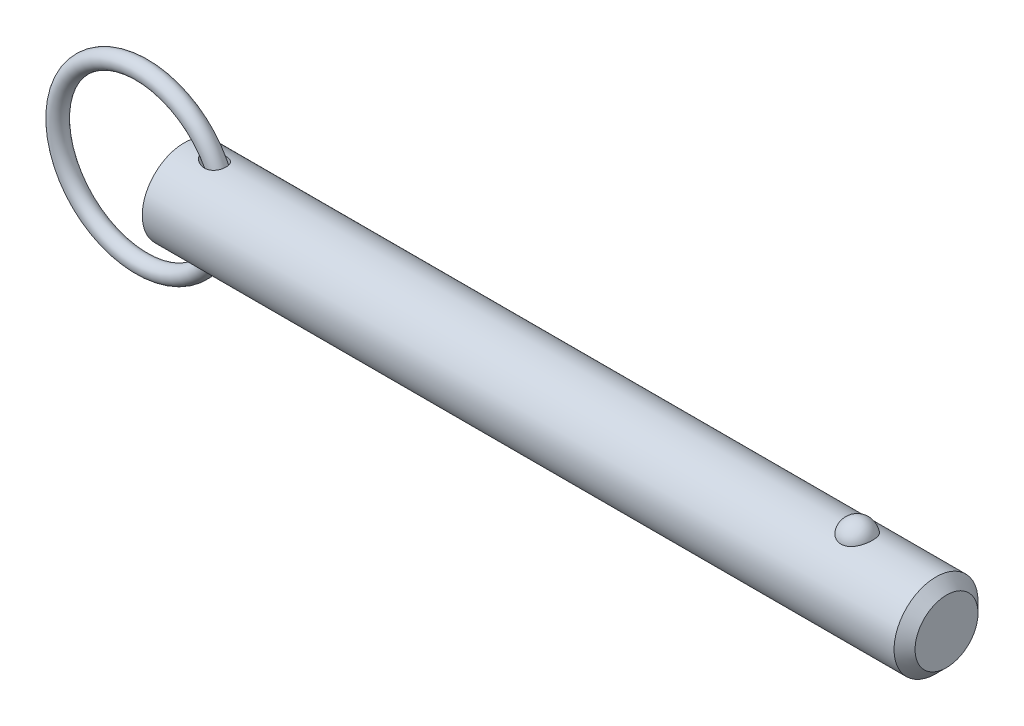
ISO-10303-21;
HEADER;
FILE_DESCRIPTION(('STEP AP214'),'2;1');
FILE_NAME('part.step','',(''),(''),'','','');
FILE_SCHEMA(('AUTOMOTIVE_DESIGN { 1 0 10303 214 1 1 1 1 }'));
ENDSEC;
DATA;
#1=APPLICATION_CONTEXT('core data for automotive mechanical design processes');
#2=APPLICATION_PROTOCOL_DEFINITION('international standard','automotive_design',2000,#1);
#3=PRODUCT_CONTEXT('',#1,'mechanical');
#4=PRODUCT('Part','Part','',(#3));
#5=PRODUCT_RELATED_PRODUCT_CATEGORY('part','',(#4));
#6=PRODUCT_DEFINITION_FORMATION('','',#4);
#7=PRODUCT_DEFINITION_CONTEXT('part definition',#1,'design');
#8=PRODUCT_DEFINITION('design','',#6,#7);
#9=PRODUCT_DEFINITION_SHAPE('','',#8);
#10=(LENGTH_UNIT() NAMED_UNIT(*) SI_UNIT(.MILLI.,.METRE.));
#11=(NAMED_UNIT(*) PLANE_ANGLE_UNIT() SI_UNIT($,.RADIAN.));
#12=(NAMED_UNIT(*) SI_UNIT($,.STERADIAN.) SOLID_ANGLE_UNIT());
#13=UNCERTAINTY_MEASURE_WITH_UNIT(LENGTH_MEASURE(1.E-05),#10,'distance_accuracy_value','');
#14=(GEOMETRIC_REPRESENTATION_CONTEXT(3) GLOBAL_UNCERTAINTY_ASSIGNED_CONTEXT((#13)) GLOBAL_UNIT_ASSIGNED_CONTEXT((#10,
#11,#12)) REPRESENTATION_CONTEXT('',''));
#15=CARTESIAN_POINT('',(0.,0.,0.));
#16=DIRECTION('',(0.,0.,1.));
#17=DIRECTION('',(1.,0.,0.));
#18=AXIS2_PLACEMENT_3D('',#15,#16,#17);
#19=CARTESIAN_POINT('',(-9.66825126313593,0.,0.));
#20=DIRECTION('',(0.,0.,1.));
#21=DIRECTION('',(1.,0.,0.));
#22=AXIS2_PLACEMENT_3D('',#19,#20,#21);
#23=TOROIDAL_SURFACE('',#22,19.05,1.905);
#24=CARTESIAN_POINT('',(11.2867487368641,0.,0.));
#25=VERTEX_POINT('',#24);
#26=VERTEX_LOOP('',#25);
#27=FACE_BOUND('',#26,.T.);
#28=ADVANCED_FACE('P0_F12',(#27),#23,.T.);
#29=CLOSED_SHELL('',(#28));
#30=MANIFOLD_SOLID_BREP('P0_B1',#29);
#31=CARTESIAN_POINT('',(0.,0.,0.));
#32=DIRECTION('',(1.,0.,0.));
#33=DIRECTION('',(0.,0.,-1.));
#34=AXIS2_PLACEMENT_3D('',#31,#32,#33);
#35=CYLINDRICAL_SURFACE('',#34,9.525);
#36=CARTESIAN_POINT('',(4.56693409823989,9.43141941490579,-1.33189820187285));
#37=CARTESIAN_POINT('',(4.70260475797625,9.41020313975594,-1.48215931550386));
#38=CARTESIAN_POINT('',(4.85555680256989,9.38755003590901,-1.61683982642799));
#39=CARTESIAN_POINT('',(5.10171959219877,9.35450554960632,-1.79512943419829));
#40=CARTESIAN_POINT('',(5.18674514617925,9.34362629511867,-1.85068909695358));
#41=CARTESIAN_POINT('',(5.3615438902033,9.32258514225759,-1.95392002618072));
#42=CARTESIAN_POINT('',(5.45131542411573,9.31242299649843,-2.00159402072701));
#43=CARTESIAN_POINT('',(5.70070211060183,9.28632120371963,-2.12033289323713));
#44=CARTESIAN_POINT('',(5.86420408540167,9.27146938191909,-2.18362944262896));
#45=CARTESIAN_POINT('',(6.19893345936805,9.24694163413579,-2.28525783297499));
#46=CARTESIAN_POINT('',(6.3701538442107,9.23726110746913,-2.32361187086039));
#47=CARTESIAN_POINT('',(6.73531776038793,9.22400982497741,-2.37575048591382));
#48=CARTESIAN_POINT('',(6.92975826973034,9.22118808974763,-2.38652934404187));
#49=CARTESIAN_POINT('',(7.21995443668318,9.22416297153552,-2.37494980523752));
#50=CARTESIAN_POINT('',(7.31643847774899,9.22635560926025,-2.366466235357));
#51=CARTESIAN_POINT('',(7.50796421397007,9.2331428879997,-2.33985028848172));
#52=CARTESIAN_POINT('',(7.6030065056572,9.23773650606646,-2.32172202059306));
#53=CARTESIAN_POINT('',(7.83273114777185,9.25183311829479,-2.26504721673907));
#54=CARTESIAN_POINT('',(7.96603028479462,9.26261470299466,-2.2209856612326));
#55=CARTESIAN_POINT('',(8.22310899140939,9.28816519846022,-2.1115730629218));
#56=CARTESIAN_POINT('',(8.34689477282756,9.30293147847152,-2.04623606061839));
#57=CARTESIAN_POINT('',(8.58136049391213,9.3349416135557,-1.89485344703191));
#58=CARTESIAN_POINT('',(8.69199721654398,9.35219324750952,-1.80874222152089));
#59=CARTESIAN_POINT('',(8.89592093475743,9.38707016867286,-1.61799188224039));
#60=CARTESIAN_POINT('',(8.98920771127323,9.40469546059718,-1.51335253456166));
#61=CARTESIAN_POINT('',(9.15057731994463,9.43713590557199,-1.29519427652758));
#62=CARTESIAN_POINT('',(9.21980158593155,9.45205440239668,-1.18253282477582));
#63=CARTESIAN_POINT('',(9.33826736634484,9.47856708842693,-0.946802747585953));
#64=CARTESIAN_POINT('',(9.38751161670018,9.49016173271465,-0.823735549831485));
#65=CARTESIAN_POINT('',(9.46423850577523,9.50859378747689,-0.57261402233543));
#66=CARTESIAN_POINT('',(9.49202393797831,9.5154972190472,-0.444656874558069));
#67=CARTESIAN_POINT('',(9.52636926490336,9.52406905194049,-0.185752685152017));
#68=CARTESIAN_POINT('',(9.53292923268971,9.52573747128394,-0.0548056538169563));
#69=CARTESIAN_POINT('',(9.52467276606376,9.52365852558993,0.20650329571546));
#70=CARTESIAN_POINT('',(9.50983454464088,9.51990564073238,0.336864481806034));
#71=CARTESIAN_POINT('',(9.45907362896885,9.50737852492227,0.593166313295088));
#72=CARTESIAN_POINT('',(9.42315106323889,9.49860432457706,0.719106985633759));
#73=CARTESIAN_POINT('',(9.3310664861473,9.4769892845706,0.96295935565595));
#74=CARTESIAN_POINT('',(9.27490839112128,9.46414923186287,1.08087260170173));
#75=CARTESIAN_POINT('',(9.14375803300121,9.43581000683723,1.30534632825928));
#76=CARTESIAN_POINT('',(9.06876720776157,9.42031103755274,1.41190767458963));
#77=CARTESIAN_POINT('',(8.90203187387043,9.38836719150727,1.61069439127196));
#78=CARTESIAN_POINT('',(8.81029913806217,9.37192298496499,1.70292975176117));
#79=CARTESIAN_POINT('',(8.6126877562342,9.33985045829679,1.87086859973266));
#80=CARTESIAN_POINT('',(8.50680947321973,9.3242221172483,1.94657251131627));
#81=CARTESIAN_POINT('',(8.28220546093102,9.29513431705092,2.08109032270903));
#82=CARTESIAN_POINT('',(8.16329919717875,9.28171415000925,2.13961034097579));
#83=CARTESIAN_POINT('',(7.91756052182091,9.25859072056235,2.23755716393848));
#84=CARTESIAN_POINT('',(7.79072606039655,9.24888842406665,2.27697900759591));
#85=CARTESIAN_POINT('',(7.52377913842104,9.23338749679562,2.33907806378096));
#86=CARTESIAN_POINT('',(7.3833476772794,9.22789571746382,2.36044900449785));
#87=CARTESIAN_POINT('',(7.1008139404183,9.22210229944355,2.3829751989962));
#88=CARTESIAN_POINT('',(6.95871103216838,9.22180269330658,2.38412253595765));
#89=CARTESIAN_POINT('',(6.65642691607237,9.22632724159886,2.36656230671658));
#90=CARTESIAN_POINT('',(6.49641694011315,9.23185415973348,2.3451317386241));
#91=CARTESIAN_POINT('',(6.18115433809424,9.24811737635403,2.28014143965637));
#92=CARTESIAN_POINT('',(6.02590710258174,9.25885936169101,2.23655754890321));
#93=CARTESIAN_POINT('',(5.69904720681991,9.28624254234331,2.12025087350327));
#94=CARTESIAN_POINT('',(5.52873601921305,9.30354853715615,2.04400672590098));
#95=CARTESIAN_POINT('',(5.20289495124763,9.34106989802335,1.86504730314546));
#96=CARTESIAN_POINT('',(5.0473596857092,9.36128419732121,1.76234172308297));
#97=CARTESIAN_POINT('',(4.79287124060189,9.39697639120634,1.55895334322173));
#98=CARTESIAN_POINT('',(4.6893870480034,9.41240250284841,1.46392900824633));
#99=CARTESIAN_POINT('',(4.4984714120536,9.44202586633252,1.25875918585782));
#100=CARTESIAN_POINT('',(4.41101129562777,9.45622528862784,1.1486413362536));
#101=CARTESIAN_POINT('',(4.27502257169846,9.47888210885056,0.940600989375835));
#102=CARTESIAN_POINT('',(4.22216329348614,9.48791121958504,0.845586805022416));
#103=CARTESIAN_POINT('',(4.13241478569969,9.50344321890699,0.648051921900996));
#104=CARTESIAN_POINT('',(4.0955118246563,9.50994827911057,0.545537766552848));
#105=CARTESIAN_POINT('',(4.04043124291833,9.51971586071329,0.334452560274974));
#106=CARTESIAN_POINT('',(4.02240728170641,9.52295176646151,0.225839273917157));
#107=CARTESIAN_POINT('',(4.00750873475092,9.52562364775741,0.00713006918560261));
#108=CARTESIAN_POINT('',(4.01062334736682,9.52506156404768,-0.102965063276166));
#109=CARTESIAN_POINT('',(4.03592967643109,9.52053221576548,-0.306944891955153));
#110=CARTESIAN_POINT('',(4.05571676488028,9.51699426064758,-0.401151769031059));
#111=CARTESIAN_POINT('',(4.10967975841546,9.5074546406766,-0.585176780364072));
#112=CARTESIAN_POINT('',(4.1438599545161,9.50145224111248,-0.674993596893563));
#113=CARTESIAN_POINT('',(4.23261356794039,9.48611703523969,-0.866116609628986));
#114=CARTESIAN_POINT('',(4.28990016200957,9.47635800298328,-0.966121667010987));
#115=CARTESIAN_POINT('',(4.4185657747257,9.45502867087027,-1.15640011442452));
#116=CARTESIAN_POINT('',(4.4899691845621,9.44345524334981,-1.24665623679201));
#117=CARTESIAN_POINT('',(4.56693409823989,9.43141941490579,-1.33189820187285));
#118=B_SPLINE_CURVE_WITH_KNOTS('',3,(#36,#37,#38,#39,#40,#41,#42,#43,#44,#45,#46,#47,#48,#49,
#50,#51,#52,#53,#54,#55,#56,#57,#58,#59,#60,#61,#62,#63,#64,#65,#66,#67,#68,#69,#70,#71,#72,#73,
#74,#75,#76,#77,#78,#79,#80,#81,#82,#83,#84,#85,#86,#87,#88,#89,#90,#91,#92,#93,#94,#95,#96,#97,
#98,#99,#100,#101,#102,#103,#104,#105,#106,#107,#108,#109,#110,#111,#112,#113,#114,#115,#116,
#117),.UNSPECIFIED.,.T.,.F.,(4,2,2,2,2,2,2,2,2,2,2,2,2,2,2,2,2,2,2,2,2,2,2,2,2,2,2,2,2,2,2,2,2,
2,2,2,2,2,2,2,4),(0.,0.609951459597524,0.916123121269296,1.22218863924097,1.74791337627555,
2.27316961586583,2.85362722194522,3.14383229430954,3.43391382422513,3.85437497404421,
4.27455920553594,4.69608835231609,5.11762282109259,5.5149005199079,5.91212379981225,
6.30363414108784,6.69514313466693,7.08705103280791,7.47895654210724,7.87078624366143,
8.26258603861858,8.65411137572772,9.04562666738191,9.44349251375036,9.84146165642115,
10.2662286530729,10.6911619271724,11.1739180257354,11.6572017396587,12.2170157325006,
12.7766249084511,13.1992556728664,13.6211226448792,13.9471990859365,14.2729943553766,
14.6014211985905,14.9296802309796,15.2173810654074,15.505167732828,15.8505863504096,
16.1966070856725),.UNSPECIFIED.);
#119=CARTESIAN_POINT('',(4.56693409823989,9.43141941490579,-1.33189820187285));
#120=VERTEX_POINT('',#119);
#121=EDGE_CURVE('P1_E40',#120,#120,#118,.T.);
#122=ORIENTED_EDGE('',*,*,#121,.T.);
#123=EDGE_LOOP('',(#122));
#124=FACE_BOUND('',#123,.T.);
#125=CARTESIAN_POINT('',(170.64875,0.,0.));
#126=DIRECTION('',(1.,0.,0.));
#127=DIRECTION('',(0.,0.,-1.));
#128=AXIS2_PLACEMENT_3D('',#125,#126,#127);
#129=CIRCLE('',#128,9.525);
#130=CARTESIAN_POINT('',(170.64875,0.,-9.525));
#131=VERTEX_POINT('',#130);
#132=EDGE_CURVE('P1_E25',#131,#131,#129,.T.);
#133=ORIENTED_EDGE('',*,*,#132,.F.);
#134=EDGE_LOOP('',(#133));
#135=FACE_BOUND('',#134,.T.);
#136=CARTESIAN_POINT('',(0.,0.,0.));
#137=DIRECTION('',(1.,0.,0.));
#138=DIRECTION('',(0.,0.,-1.));
#139=AXIS2_PLACEMENT_3D('',#136,#137,#138);
#140=CIRCLE('',#139,9.525);
#141=CARTESIAN_POINT('',(0.,0.,-9.525));
#142=VERTEX_POINT('',#141);
#143=EDGE_CURVE('P1_E9',#142,#142,#140,.T.);
#144=ORIENTED_EDGE('',*,*,#143,.T.);
#145=EDGE_LOOP('',(#144));
#146=FACE_BOUND('',#145,.T.);
#147=CARTESIAN_POINT('',(152.745757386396,8.80405803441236,3.63513233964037));
#148=CARTESIAN_POINT('',(152.651676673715,8.80405953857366,3.63513053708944));
#149=CARTESIAN_POINT('',(152.557561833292,8.80561325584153,3.63137461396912));
#150=CARTESIAN_POINT('',(152.370012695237,8.81177748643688,3.616386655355));
#151=CARTESIAN_POINT('',(152.276578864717,8.81638992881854,3.60514990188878));
#152=CARTESIAN_POINT('',(151.997945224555,8.83467114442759,3.56024627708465));
#153=CARTESIAN_POINT('',(151.814691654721,8.85278327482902,3.51538626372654));
#154=CARTESIAN_POINT('',(151.459509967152,8.89871214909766,3.39742145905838));
#155=CARTESIAN_POINT('',(151.287553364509,8.9265032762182,3.32439116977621));
#156=CARTESIAN_POINT('',(150.958707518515,8.98874819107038,3.15220244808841));
#157=CARTESIAN_POINT('',(150.801811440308,9.02319893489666,3.053055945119));
#158=CARTESIAN_POINT('',(150.502214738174,9.0962918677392,2.82797815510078));
#159=CARTESIAN_POINT('',(150.360060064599,9.13502685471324,2.70135138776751));
#160=CARTESIAN_POINT('',(150.098299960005,9.21186572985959,2.42641932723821));
#161=CARTESIAN_POINT('',(149.978701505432,9.2499694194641,2.27810735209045));
#162=CARTESIAN_POINT('',(149.759645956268,9.3234108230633,1.95652290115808));
#163=CARTESIAN_POINT('',(149.661317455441,9.35855090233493,1.78243511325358));
#164=CARTESIAN_POINT('',(149.493819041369,9.42045142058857,1.41937246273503));
#165=CARTESIAN_POINT('',(149.424651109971,9.44721128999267,1.23039658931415));
#166=CARTESIAN_POINT('',(149.316199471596,9.48990641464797,0.840370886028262));
#167=CARTESIAN_POINT('',(149.277288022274,9.50570658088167,0.639202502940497));
#168=CARTESIAN_POINT('',(149.231555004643,9.52433146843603,0.232664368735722));
#169=CARTESIAN_POINT('',(149.224732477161,9.52715657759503,0.0272947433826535));
#170=CARTESIAN_POINT('',(149.243255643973,9.51956918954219,-0.380478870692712));
#171=CARTESIAN_POINT('',(149.268405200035,9.50923740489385,-0.582893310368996));
#172=CARTESIAN_POINT('',(149.35002537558,9.47651897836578,-0.980293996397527));
#173=CARTESIAN_POINT('',(149.406496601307,9.45413210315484,-1.17528009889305));
#174=CARTESIAN_POINT('',(149.549719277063,9.39954044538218,-1.55263697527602));
#175=CARTESIAN_POINT('',(149.636512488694,9.36732213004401,-1.73498993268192));
#176=CARTESIAN_POINT('',(149.838610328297,9.29640700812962,-2.08177763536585));
#177=CARTESIAN_POINT('',(149.953917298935,9.25770966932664,-2.24621090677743));
#178=CARTESIAN_POINT('',(150.211264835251,9.17775604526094,-2.55338333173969));
#179=CARTESIAN_POINT('',(150.353434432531,9.136488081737,-2.69601150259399));
#180=CARTESIAN_POINT('',(150.66089985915,9.05620497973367,-2.95451229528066));
#181=CARTESIAN_POINT('',(150.826193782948,9.01718965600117,-3.07038711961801));
#182=CARTESIAN_POINT('',(151.172052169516,8.9468001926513,-3.26976836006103));
#183=CARTESIAN_POINT('',(151.352227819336,8.91528408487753,-3.35389750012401));
#184=CARTESIAN_POINT('',(151.725651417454,8.86272514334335,-3.49043503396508));
#185=CARTESIAN_POINT('',(151.918894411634,8.8416783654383,-3.54285537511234));
#186=CARTESIAN_POINT('',(152.302503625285,8.81348056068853,-3.61241306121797));
#187=CARTESIAN_POINT('',(152.492525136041,8.80568348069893,-3.63119339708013));
#188=CARTESIAN_POINT('',(152.873190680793,8.80289410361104,-3.6379534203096));
#189=CARTESIAN_POINT('',(153.063834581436,8.8078992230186,-3.6259393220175));
#190=CARTESIAN_POINT('',(153.434007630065,8.82974915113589,-3.57238430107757));
#191=CARTESIAN_POINT('',(153.613697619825,8.84621463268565,-3.53178890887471));
#192=CARTESIAN_POINT('',(153.963422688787,8.88875330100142,-3.42331083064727));
#193=CARTESIAN_POINT('',(154.133456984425,8.91482726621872,-3.35542593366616));
#194=CARTESIAN_POINT('',(154.463237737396,8.97448239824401,-3.19248225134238));
#195=CARTESIAN_POINT('',(154.622680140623,9.00821446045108,-3.09686474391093));
#196=CARTESIAN_POINT('',(154.923513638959,9.0793539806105,-2.88162736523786));
#197=CARTESIAN_POINT('',(155.064900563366,9.11676228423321,-2.76200196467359));
#198=CARTESIAN_POINT('',(155.33331931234,9.19347419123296,-2.49516285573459));
#199=CARTESIAN_POINT('',(155.459275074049,9.23277872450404,-2.3468661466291));
#200=CARTESIAN_POINT('',(155.685522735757,9.30737610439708,-2.03093683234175));
#201=CARTESIAN_POINT('',(155.78581004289,9.34266823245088,-1.86330077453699));
#202=CARTESIAN_POINT('',(155.961514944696,9.40674710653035,-1.50744893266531));
#203=CARTESIAN_POINT('',(156.036041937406,9.4352917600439,-1.31874876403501));
#204=CARTESIAN_POINT('',(156.15416505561,9.4814413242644,-0.930631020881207));
#205=CARTESIAN_POINT('',(156.197760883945,9.49904612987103,-0.731213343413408));
#206=CARTESIAN_POINT('',(156.253158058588,9.5215314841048,-0.327147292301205));
#207=CARTESIAN_POINT('',(156.264935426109,9.52640243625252,-0.122495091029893));
#208=CARTESIAN_POINT('',(156.256382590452,9.52289571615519,0.286018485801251));
#209=CARTESIAN_POINT('',(156.23605305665,9.51451832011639,0.48987987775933));
#210=CARTESIAN_POINT('',(156.163884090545,9.48544083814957,0.889994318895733));
#211=CARTESIAN_POINT('',(156.112199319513,9.46480124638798,1.08627971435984));
#212=CARTESIAN_POINT('',(155.978491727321,9.4133389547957,1.46682086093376));
#213=CARTESIAN_POINT('',(155.896466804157,9.38251554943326,1.65107577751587));
#214=CARTESIAN_POINT('',(155.70319292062,9.31365636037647,2.00346348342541));
#215=CARTESIAN_POINT('',(155.591783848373,9.27558138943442,2.17150083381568));
#216=CARTESIAN_POINT('',(155.342294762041,9.19638714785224,2.48563115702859));
#217=CARTESIAN_POINT('',(155.204216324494,9.15526805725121,2.63172542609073));
#218=CARTESIAN_POINT('',(154.904843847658,9.07465393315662,2.89750997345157));
#219=CARTESIAN_POINT('',(154.743610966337,9.03515496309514,3.01726776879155));
#220=CARTESIAN_POINT('',(154.401613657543,8.96227564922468,3.22732920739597));
#221=CARTESIAN_POINT('',(154.220841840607,8.92889763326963,3.31762165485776));
#222=CARTESIAN_POINT('',(153.851445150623,8.87345380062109,3.46314419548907));
#223=CARTESIAN_POINT('',(153.66332371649,8.85102983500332,3.51950082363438));
#224=CARTESIAN_POINT('',(153.37578699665,8.82666967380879,3.57993683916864));
#225=CARTESIAN_POINT('',(153.279133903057,8.82009725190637,3.59606217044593));
#226=CARTESIAN_POINT('',(153.084677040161,8.81020897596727,3.62022512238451));
#227=CARTESIAN_POINT('',(152.98687410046,8.80689090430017,3.62826825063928));
#228=CARTESIAN_POINT('',(152.841224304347,8.80445615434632,3.63416760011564));
#229=CARTESIAN_POINT('',(152.793495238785,8.80405727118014,3.63513325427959));
#230=CARTESIAN_POINT('',(152.745757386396,8.80405803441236,3.63513233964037));
#231=B_SPLINE_CURVE_WITH_KNOTS('',3,(#147,#148,#149,#150,#151,#152,#153,#154,#155,#156,#157,
#158,#159,#160,#161,#162,#163,#164,#165,#166,#167,#168,#169,#170,#171,#172,#173,#174,#175,#176,
#177,#178,#179,#180,#181,#182,#183,#184,#185,#186,#187,#188,#189,#190,#191,#192,#193,#194,#195,
#196,#197,#198,#199,#200,#201,#202,#203,#204,#205,#206,#207,#208,#209,#210,#211,#212,#213,#214,
#215,#216,#217,#218,#219,#220,#221,#222,#223,#224,#225,#226,#227,#228,#229,#230),.UNSPECIFIED.,
.T.,.F.,(4,2,2,2,2,2,2,2,2,2,2,2,2,2,2,2,2,2,2,2,2,2,2,2,2,2,2,2,2,2,2,2,2,2,2,2,2,2,2,2,2,4),
(0.,0.282202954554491,0.564584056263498,1.13017050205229,1.69427128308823,2.25811483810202,
2.83836627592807,3.41879688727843,4.02497117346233,4.63118665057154,5.24474754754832,
5.85829010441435,6.46808687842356,7.07789545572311,7.68854723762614,8.29924920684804,
8.91296283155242,9.52662591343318,10.1275338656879,10.7282152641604,11.2986646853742,
11.868998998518,12.4213015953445,12.9736489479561,13.5380053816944,14.1024919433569,
14.695298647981,15.2882113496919,15.8999469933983,16.5116885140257,17.1238909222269,
17.7360805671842,18.3452748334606,18.9545113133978,19.5671386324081,20.1797297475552,
20.7907316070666,21.4019653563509,21.9915938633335,22.2859053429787,22.580016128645,
22.7232098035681),.UNSPECIFIED.);
#232=CARTESIAN_POINT('',(152.745757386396,8.80405803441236,3.63513233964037));
#233=VERTEX_POINT('',#232);
#234=EDGE_CURVE('P1_E34',#233,#233,#231,.T.);
#235=ORIENTED_EDGE('',*,*,#234,.T.);
#236=EDGE_LOOP('',(#235));
#237=FACE_BOUND('',#236,.T.);
#238=CARTESIAN_POINT('',(4.56693409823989,-9.43141941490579,-1.33189820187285));
#239=CARTESIAN_POINT('',(4.48932984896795,-9.4435553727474,-1.24594548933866));
#240=CARTESIAN_POINT('',(4.41737309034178,-9.45522193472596,-1.1548795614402));
#241=CARTESIAN_POINT('',(4.28781047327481,-9.47670896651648,-0.962782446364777));
#242=CARTESIAN_POINT('',(4.23019403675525,-9.48653079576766,-0.861758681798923));
#243=CARTESIAN_POINT('',(4.132545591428,-9.5034118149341,-0.649723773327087));
#244=CARTESIAN_POINT('',(4.09271158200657,-9.51043980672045,-0.538615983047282));
#245=CARTESIAN_POINT('',(4.04973167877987,-9.51806966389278,-0.367764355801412));
#246=CARTESIAN_POINT('',(4.03820037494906,-9.52012756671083,-0.310118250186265));
#247=CARTESIAN_POINT('',(4.02100287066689,-9.52320274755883,-0.193935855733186));
#248=CARTESIAN_POINT('',(4.01533565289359,-9.52422020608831,-0.135399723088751));
#249=CARTESIAN_POINT('',(4.0081707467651,-9.52550497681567,0.0247266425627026));
#250=CARTESIAN_POINT('',(4.0127049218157,-9.52468821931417,0.126661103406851));
#251=CARTESIAN_POINT('',(4.03954973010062,-9.51988506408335,0.328012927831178));
#252=CARTESIAN_POINT('',(4.06186450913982,-9.51589792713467,0.42742969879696));
#253=CARTESIAN_POINT('',(4.12088980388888,-9.5054852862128,0.616362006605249));
#254=CARTESIAN_POINT('',(4.15684838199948,-9.49918763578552,0.706123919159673));
#255=CARTESIAN_POINT('',(4.24094647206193,-9.48470618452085,0.879522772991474));
#256=CARTESIAN_POINT('',(4.28909090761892,-9.47652162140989,0.96315722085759));
#257=CARTESIAN_POINT('',(4.42295891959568,-9.45426317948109,1.16513741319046));
#258=CARTESIAN_POINT('',(4.51523752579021,-9.43933320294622,1.27905352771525));
#259=CARTESIAN_POINT('',(4.71682295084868,-9.40825940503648,1.49055892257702));
#260=CARTESIAN_POINT('',(4.82617286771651,-9.39211256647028,1.58810554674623));
#261=CARTESIAN_POINT('',(5.09064226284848,-9.35555264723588,1.79246125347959));
#262=CARTESIAN_POINT('',(5.2499041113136,-9.33524115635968,1.89393122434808));
#263=CARTESIAN_POINT('',(5.58309255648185,-9.29785396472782,2.06968659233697));
#264=CARTESIAN_POINT('',(5.75702897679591,-9.28078045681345,2.14395359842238));
#265=CARTESIAN_POINT('',(6.11646882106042,-9.25213303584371,2.26440412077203));
#266=CARTESIAN_POINT('',(6.30205582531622,-9.2406056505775,2.31035092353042));
#267=CARTESIAN_POINT('',(6.67856093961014,-9.22541807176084,2.37029728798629));
#268=CARTESIAN_POINT('',(6.8694704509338,-9.2217458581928,2.3843456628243));
#269=CARTESIAN_POINT('',(7.21217144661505,-9.22344239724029,2.37775005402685));
#270=CARTESIAN_POINT('',(7.36409439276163,-9.22713860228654,2.36352577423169));
#271=CARTESIAN_POINT('',(7.66346227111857,-9.24048072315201,2.31082299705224));
#272=CARTESIAN_POINT('',(7.81090958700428,-9.25012341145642,2.27235765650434));
#273=CARTESIAN_POINT('',(8.09730316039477,-9.2746609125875,2.17003648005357));
#274=CARTESIAN_POINT('',(8.2361965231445,-9.28958517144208,2.10603803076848));
#275=CARTESIAN_POINT('',(8.49918675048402,-9.32290326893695,1.95324442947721));
#276=CARTESIAN_POINT('',(8.62328895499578,-9.34129584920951,1.86445826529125));
#277=CARTESIAN_POINT('',(8.84006515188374,-9.37706953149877,1.67466761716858));
#278=CARTESIAN_POINT('',(8.93465172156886,-9.39436331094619,1.57582357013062));
#279=CARTESIAN_POINT('',(9.10490234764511,-9.42761680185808,1.362809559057));
#280=CARTESIAN_POINT('',(9.18057146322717,-9.44357686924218,1.24864370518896));
#281=CARTESIAN_POINT('',(9.30789178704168,-9.47159985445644,1.01379272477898));
#282=CARTESIAN_POINT('',(9.36045544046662,-9.48380365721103,0.893617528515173));
#283=CARTESIAN_POINT('',(9.44498362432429,-9.50388751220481,0.645890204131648));
#284=CARTESIAN_POINT('',(9.47694947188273,-9.51176784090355,0.518338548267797));
#285=CARTESIAN_POINT('',(9.51944262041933,-9.52232073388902,0.260103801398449));
#286=CARTESIAN_POINT('',(9.53006646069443,-9.52501674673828,0.129437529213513));
#287=CARTESIAN_POINT('',(9.52993291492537,-9.52498309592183,-0.131885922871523));
#288=CARTESIAN_POINT('',(9.51917525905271,-9.52225336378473,-0.26254310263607));
#289=CARTESIAN_POINT('',(9.47648788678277,-9.51165418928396,-0.520312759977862));
#290=CARTESIAN_POINT('',(9.44453086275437,-9.50377811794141,-0.647420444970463));
#291=CARTESIAN_POINT('',(9.36015568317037,-9.48373425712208,-0.89429087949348));
#292=CARTESIAN_POINT('',(9.30773827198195,-9.47156662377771,-1.01405389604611));
#293=CARTESIAN_POINT('',(9.1838089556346,-9.44428888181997,-1.24269386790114));
#294=CARTESIAN_POINT('',(9.11232064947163,-9.42918241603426,-1.3515840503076));
#295=CARTESIAN_POINT('',(8.9521268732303,-9.39767706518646,-1.55562459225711));
#296=CARTESIAN_POINT('',(8.86342281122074,-9.3812782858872,-1.65077607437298));
#297=CARTESIAN_POINT('',(8.6710444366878,-9.34891827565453,-1.82517515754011));
#298=CARTESIAN_POINT('',(8.56732858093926,-9.33295841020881,-1.90437711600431));
#299=CARTESIAN_POINT('',(8.34818438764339,-9.30317889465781,-2.0449122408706));
#300=CARTESIAN_POINT('',(8.23275529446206,-9.28935938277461,-2.10624425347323));
#301=CARTESIAN_POINT('',(7.98961240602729,-9.26475003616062,-2.2120340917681));
#302=CARTESIAN_POINT('',(7.86162088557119,-9.25407358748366,-2.25587700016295));
#303=CARTESIAN_POINT('',(7.60027499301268,-9.23720810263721,-2.32397032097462));
#304=CARTESIAN_POINT('',(7.46691858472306,-9.23102078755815,-2.34821321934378));
#305=CARTESIAN_POINT('',(7.18516230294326,-9.22302718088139,-2.37943079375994));
#306=CARTESIAN_POINT('',(7.03654454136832,-9.22169704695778,-2.38452997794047));
#307=CARTESIAN_POINT('',(6.74015049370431,-9.22442327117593,-2.37395141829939));
#308=CARTESIAN_POINT('',(6.59237455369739,-9.22848170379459,-2.35826567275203));
#309=CARTESIAN_POINT('',(6.27762777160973,-9.2422287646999,-2.30385559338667));
#310=CARTESIAN_POINT('',(6.11124715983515,-9.25269504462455,-2.26192683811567));
#311=CARTESIAN_POINT('',(5.78635920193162,-9.27830776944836,-2.15445569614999));
#312=CARTESIAN_POINT('',(5.62786567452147,-9.29346211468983,-2.08887341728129));
#313=CARTESIAN_POINT('',(5.39013065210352,-9.31931237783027,-1.96924953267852));
#314=CARTESIAN_POINT('',(5.30683088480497,-9.32901725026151,-1.92292485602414));
#315=CARTESIAN_POINT('',(5.1445580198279,-9.34899035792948,-1.82334419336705));
#316=CARTESIAN_POINT('',(5.06558607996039,-9.35925874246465,-1.77008636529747));
#317=CARTESIAN_POINT('',(4.83670950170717,-9.39034445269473,-1.60010986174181));
#318=CARTESIAN_POINT('',(4.69422471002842,-9.41151337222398,-1.47288240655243));
#319=CARTESIAN_POINT('',(4.56693409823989,-9.43141941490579,-1.33189820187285));
#320=B_SPLINE_CURVE_WITH_KNOTS('',3,(#238,#239,#240,#241,#242,#243,#244,#245,#246,#247,#248,
#249,#250,#251,#252,#253,#254,#255,#256,#257,#258,#259,#260,#261,#262,#263,#264,#265,#266,#267,
#268,#269,#270,#271,#272,#273,#274,#275,#276,#277,#278,#279,#280,#281,#282,#283,#284,#285,#286,
#287,#288,#289,#290,#291,#292,#293,#294,#295,#296,#297,#298,#299,#300,#301,#302,#303,#304,#305,
#306,#307,#308,#309,#310,#311,#312,#313,#314,#315,#316,#317,#318,#319),.UNSPECIFIED.,.T.,.F.,(4,
2,2,2,2,2,2,2,2,2,2,2,2,2,2,2,2,2,2,2,2,2,2,2,2,2,2,2,2,2,2,2,2,2,2,2,2,2,2,2,4),(0.,
0.348900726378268,0.697543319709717,1.0499765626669,1.22617690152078,1.40234666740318,
1.70666745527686,2.01105922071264,2.30066493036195,2.59038784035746,3.03001384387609,
3.4707682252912,4.03766594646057,4.60494622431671,5.17690598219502,5.74798989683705,
6.20400848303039,6.65977977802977,7.11813321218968,7.57632066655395,7.98791759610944,
8.39940433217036,8.7927345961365,9.18603970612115,9.577561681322,9.9690885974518,
10.3611208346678,10.7531388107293,11.1446739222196,11.536177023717,11.9287850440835,
12.3214184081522,12.7268448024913,13.1324265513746,13.5768390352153,14.0214226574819,
14.5351685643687,15.0497849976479,15.3368801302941,15.6240516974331,16.1963372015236),.UNSPECIFIED.);
#321=CARTESIAN_POINT('',(4.56693409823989,-9.43141941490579,-1.33189820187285));
#322=VERTEX_POINT('',#321);
#323=EDGE_CURVE('P1_E17',#322,#322,#320,.T.);
#324=ORIENTED_EDGE('',*,*,#323,.T.);
#325=EDGE_LOOP('',(#324));
#326=FACE_BOUND('',#325,.T.);
#327=ADVANCED_FACE('P1_F13',(#124,#135,#146,#237,#326),#35,.T.);
#328=CARTESIAN_POINT('',(0.,0.,0.));
#329=DIRECTION('',(-1.,0.,0.));
#330=DIRECTION('',(0.,0.,1.));
#331=AXIS2_PLACEMENT_3D('',#328,#329,#330);
#332=PLANE('',#331);
#333=ORIENTED_EDGE('',*,*,#143,.F.);
#334=EDGE_LOOP('',(#333));
#335=FACE_BOUND('',#334,.T.);
#336=ADVANCED_FACE('P1_F15',(#335),#332,.T.);
#337=CARTESIAN_POINT('',(173.03,0.,0.));
#338=DIRECTION('',(-1.,0.,0.));
#339=DIRECTION('',(0.,0.,1.));
#340=AXIS2_PLACEMENT_3D('',#337,#338,#339);
#341=CONICAL_SURFACE('',#340,7.14375000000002,0.785398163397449);
#342=ORIENTED_EDGE('',*,*,#132,.T.);
#343=EDGE_LOOP('',(#342));
#344=FACE_BOUND('',#343,.T.);
#345=CARTESIAN_POINT('',(173.03,0.,0.));
#346=DIRECTION('',(1.,0.,0.));
#347=DIRECTION('',(0.,0.,-1.));
#348=AXIS2_PLACEMENT_3D('',#345,#346,#347);
#349=CIRCLE('',#348,7.14375000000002);
#350=CARTESIAN_POINT('',(173.03,0.,-7.14375000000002));
#351=VERTEX_POINT('',#350);
#352=EDGE_CURVE('P1_E30',#351,#351,#349,.T.);
#353=ORIENTED_EDGE('',*,*,#352,.F.);
#354=EDGE_LOOP('',(#353));
#355=FACE_BOUND('',#354,.T.);
#356=ADVANCED_FACE('P1_F55',(#344,#355),#341,.T.);
#357=CARTESIAN_POINT('',(173.03,7.14375000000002,0.));
#358=DIRECTION('',(1.,0.,0.));
#359=DIRECTION('',(0.,0.,-1.));
#360=AXIS2_PLACEMENT_3D('',#357,#358,#359);
#361=PLANE('',#360);
#362=ORIENTED_EDGE('',*,*,#352,.T.);
#363=EDGE_LOOP('',(#362));
#364=FACE_BOUND('',#363,.T.);
#365=ADVANCED_FACE('P1_F51',(#364),#361,.T.);
#366=CARTESIAN_POINT('',(152.745757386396,8.57249999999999,0.));
#367=DIRECTION('',(-1.,0.,0.));
#368=DIRECTION('',(0.,1.,0.));
#369=AXIS2_PLACEMENT_3D('',#366,#367,#368);
#370=SPHERICAL_SURFACE('',#369,3.64250000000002);
#371=ORIENTED_EDGE('',*,*,#234,.F.);
#372=EDGE_LOOP('',(#371));
#373=FACE_BOUND('',#372,.T.);
#374=ADVANCED_FACE('P1_F46',(#373),#370,.T.);
#375=CARTESIAN_POINT('',(-9.66825126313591,0.,0.));
#376=DIRECTION('',(0.,0.,1.));
#377=DIRECTION('',(1.,0.,0.));
#378=AXIS2_PLACEMENT_3D('',#375,#376,#377);
#379=TOROIDAL_SURFACE('',#378,19.05,2.38125);
#380=ORIENTED_EDGE('',*,*,#323,.F.);
#381=EDGE_LOOP('',(#380));
#382=FACE_BOUND('',#381,.T.);
#383=ORIENTED_EDGE('',*,*,#121,.F.);
#384=EDGE_LOOP('',(#383));
#385=FACE_BOUND('',#384,.T.);
#386=ADVANCED_FACE('P1_F50',(#382,#385),#379,.F.);
#387=CLOSED_SHELL('',(#327,#336,#356,#365,#374,#386));
#388=MANIFOLD_SOLID_BREP('P1_B1',#387);
#389=ADVANCED_BREP_SHAPE_REPRESENTATION('',(#18,#30,#388),#14);
#390=SHAPE_DEFINITION_REPRESENTATION(#9,#389);
ENDSEC;
END-ISO-10303-21;
